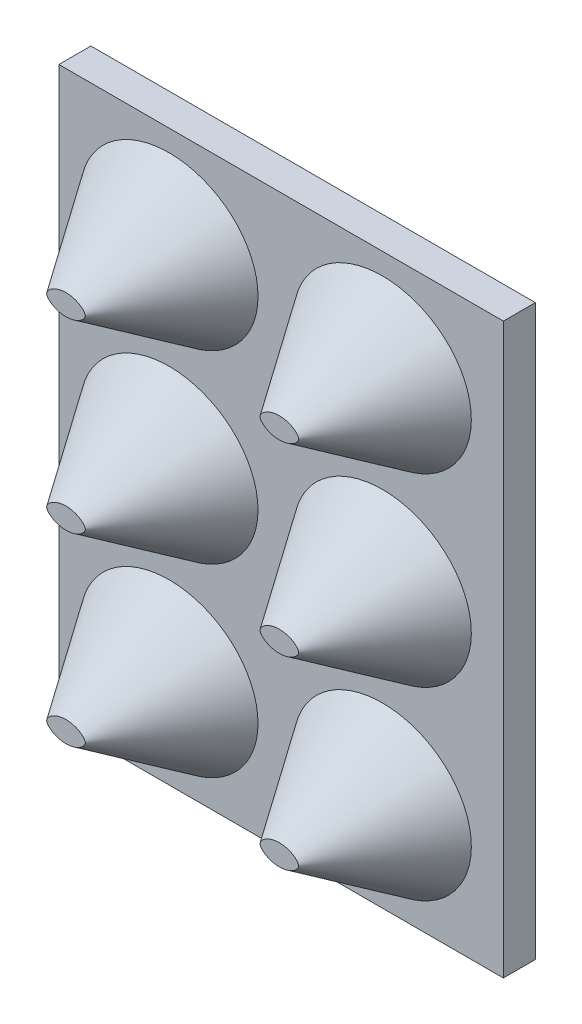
from build123d import *

# Parameters (mm, degrees)
SKETCH1_W            = 125
SKETCH1_H            = 160
BOSS_EXTRUDE1_DEPTH  = 9
SKETCH2_RX           = 25
SKETCH2_RY           = 22.5
BOSS_EXTRUDE2_DEPTH  = 29
BOSS_EXTRUDE2_TAPER  = 34
LPATTERN1_COUNT      = 3
LPATTERN1_PITCH      = 52
LPATTERN1_COUNT_DIR2 = 2
LPATTERN1_PITCH_DIR2 = 60


with BuildPart() as part:
    # Sketch1 → Boss-Extrude1 (new body)
    with BuildSketch(Plane.XY):
        with Locations((-62.5, 80)):
            Rectangle(SKETCH1_W, SKETCH1_H)
    extrude(amount=BOSS_EXTRUDE1_DEPTH)

    # Sketch2 → Boss-Extrude2 (add)
    with BuildSketch(Plane.XY.offset(9)):
        with Locations(Location((-94, 27.5), (0, 0, -180))):
            Ellipse(SKETCH2_RX, SKETCH2_RY)
    boss_extrude2 = extrude(amount=BOSS_EXTRUDE2_DEPTH, taper=BOSS_EXTRUDE2_TAPER)

    # LPattern1: Boss-Extrude2 3 × 2
    with Locations(*[(j * LPATTERN1_PITCH_DIR2, i * LPATTERN1_PITCH, 0) for i in range(LPATTERN1_COUNT) for j in range(LPATTERN1_COUNT_DIR2) if (i, j) != (0, 0)]):
        add(boss_extrude2)


solid = part.part
